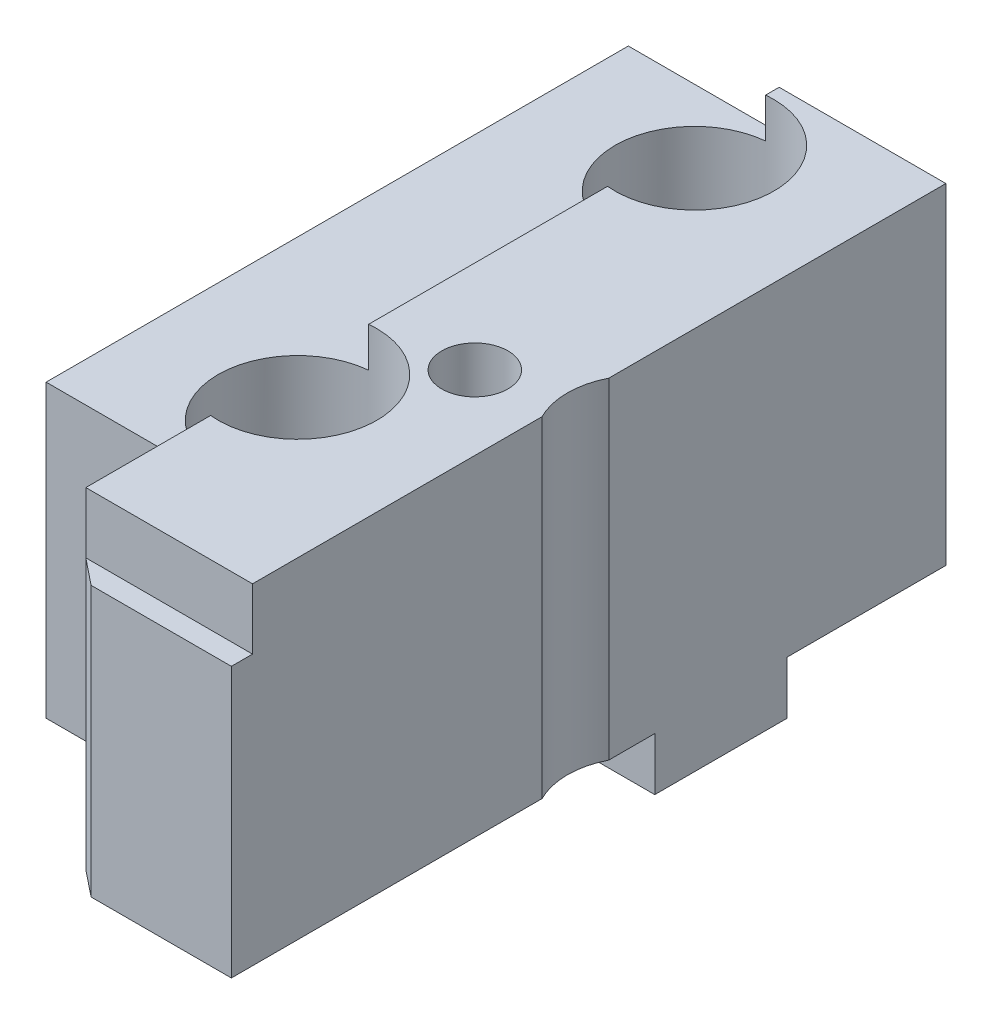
ISO-10303-21;
HEADER;
FILE_DESCRIPTION(('STEP AP214'),'2;1');
FILE_NAME('part.step','',(''),(''),'','','');
FILE_SCHEMA(('AUTOMOTIVE_DESIGN { 1 0 10303 214 1 1 1 1 }'));
ENDSEC;
DATA;
#1=APPLICATION_CONTEXT('core data for automotive mechanical design processes');
#2=APPLICATION_PROTOCOL_DEFINITION('international standard','automotive_design',2000,#1);
#3=PRODUCT_CONTEXT('',#1,'mechanical');
#4=PRODUCT('Part','Part','',(#3));
#5=PRODUCT_RELATED_PRODUCT_CATEGORY('part','',(#4));
#6=PRODUCT_DEFINITION_FORMATION('','',#4);
#7=PRODUCT_DEFINITION_CONTEXT('part definition',#1,'design');
#8=PRODUCT_DEFINITION('design','',#6,#7);
#9=PRODUCT_DEFINITION_SHAPE('','',#8);
#10=(LENGTH_UNIT() NAMED_UNIT(*) SI_UNIT(.MILLI.,.METRE.));
#11=(NAMED_UNIT(*) PLANE_ANGLE_UNIT() SI_UNIT($,.RADIAN.));
#12=(NAMED_UNIT(*) SI_UNIT($,.STERADIAN.) SOLID_ANGLE_UNIT());
#13=UNCERTAINTY_MEASURE_WITH_UNIT(LENGTH_MEASURE(1.E-05),#10,'distance_accuracy_value','');
#14=(GEOMETRIC_REPRESENTATION_CONTEXT(3) GLOBAL_UNCERTAINTY_ASSIGNED_CONTEXT((#13)) GLOBAL_UNIT_ASSIGNED_CONTEXT((#10,
#11,#12)) REPRESENTATION_CONTEXT('',''));
#15=CARTESIAN_POINT('',(0.,0.,0.));
#16=DIRECTION('',(0.,0.,1.));
#17=DIRECTION('',(1.,0.,0.));
#18=AXIS2_PLACEMENT_3D('',#15,#16,#17);
#19=CARTESIAN_POINT('',(0.,0.,-27.));
#20=DIRECTION('',(0.,1.,0.));
#21=DIRECTION('',(0.,0.,-1.));
#22=AXIS2_PLACEMENT_3D('',#19,#20,#21);
#23=PLANE('',#22);
#24=CARTESIAN_POINT('',(-6.,0.,-8.5));
#25=DIRECTION('',(0.,-1.,0.));
#26=DIRECTION('',(0.,0.,-1.));
#27=AXIS2_PLACEMENT_3D('',#24,#25,#26);
#28=CIRCLE('',#27,1.7);
#29=CARTESIAN_POINT('',(-6.,0.,-10.2));
#30=VERTEX_POINT('',#29);
#31=EDGE_CURVE('E201',#30,#30,#28,.T.);
#32=ORIENTED_EDGE('',*,*,#31,.F.);
#33=EDGE_LOOP('',(#32));
#34=FACE_BOUND('',#33,.T.);
#35=CARTESIAN_POINT('',(-2.8,0.,-12.));
#36=DIRECTION('',(0.,-1.,0.));
#37=DIRECTION('',(0.,0.,-1.));
#38=AXIS2_PLACEMENT_3D('',#35,#36,#37);
#39=CIRCLE('',#38,1.25);
#40=CARTESIAN_POINT('',(-2.8,0.,-13.25));
#41=VERTEX_POINT('',#40);
#42=EDGE_CURVE('E232',#41,#41,#39,.T.);
#43=ORIENTED_EDGE('',*,*,#42,.F.);
#44=EDGE_LOOP('',(#43));
#45=FACE_BOUND('',#44,.T.);
#46=DIRECTION('',(1.,0.,0.));
#47=VECTOR('',#46,1.);
#48=CARTESIAN_POINT('',(-12.,0.,-16.));
#49=LINE('',#48,#47);
#50=CARTESIAN_POINT('',(-12.,0.,-16.));
#51=VERTEX_POINT('',#50);
#52=CARTESIAN_POINT('',(0.,0.,-16.));
#53=VERTEX_POINT('',#52);
#54=EDGE_CURVE('E181',#51,#53,#49,.T.);
#55=ORIENTED_EDGE('',*,*,#54,.T.);
#56=DIRECTION('',(0.,0.,1.));
#57=VECTOR('',#56,1.);
#58=CARTESIAN_POINT('',(0.,0.,-27.));
#59=LINE('',#58,#57);
#60=CARTESIAN_POINT('',(0.,0.,-14.2609520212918));
#61=VERTEX_POINT('',#60);
#62=EDGE_CURVE('E298',#53,#61,#59,.T.);
#63=ORIENTED_EDGE('',*,*,#62,.T.);
#64=CARTESIAN_POINT('',(2.5,0.,-13.));
#65=DIRECTION('',(0.,-1.,0.));
#66=DIRECTION('',(0.,0.,-1.));
#67=AXIS2_PLACEMENT_3D('',#64,#65,#66);
#68=CIRCLE('',#67,2.8);
#69=CARTESIAN_POINT('',(0.,0.,-11.7390479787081));
#70=VERTEX_POINT('',#69);
#71=EDGE_CURVE('E236',#70,#61,#68,.T.);
#72=ORIENTED_EDGE('',*,*,#71,.F.);
#73=CARTESIAN_POINT('',(0.,0.,0.));
#74=VERTEX_POINT('',#73);
#75=EDGE_CURVE('E290',#70,#74,#59,.T.);
#76=ORIENTED_EDGE('',*,*,#75,.T.);
#77=DIRECTION('',(1.,0.,0.));
#78=VECTOR('',#77,1.);
#79=CARTESIAN_POINT('',(0.,0.,0.));
#80=LINE('',#79,#78);
#81=CARTESIAN_POINT('',(-5.3,0.,0.));
#82=VERTEX_POINT('',#81);
#83=EDGE_CURVE('E277',#82,#74,#80,.T.);
#84=ORIENTED_EDGE('',*,*,#83,.F.);
#85=DIRECTION('',(-0.780868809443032,0.,-0.624695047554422));
#86=VECTOR('',#85,1.);
#87=CARTESIAN_POINT('',(-6.3,0.,-0.8));
#88=LINE('',#87,#86);
#89=CARTESIAN_POINT('',(-6.3,0.,-0.8));
#90=VERTEX_POINT('',#89);
#91=EDGE_CURVE('E310',#90,#82,#88,.F.);
#92=ORIENTED_EDGE('',*,*,#91,.F.);
#93=DIRECTION('',(0.,0.,1.));
#94=VECTOR('',#93,1.);
#95=CARTESIAN_POINT('',(-6.3,0.,0.));
#96=LINE('',#95,#94);
#97=CARTESIAN_POINT('',(-6.3,0.,-5.));
#98=VERTEX_POINT('',#97);
#99=EDGE_CURVE('E264',#98,#90,#96,.T.);
#100=ORIENTED_EDGE('',*,*,#99,.F.);
#101=DIRECTION('',(1.,0.,0.));
#102=VECTOR('',#101,1.);
#103=CARTESIAN_POINT('',(-12.,0.,-5.));
#104=LINE('',#103,#102);
#105=CARTESIAN_POINT('',(-12.,0.,-5.));
#106=VERTEX_POINT('',#105);
#107=EDGE_CURVE('E261',#106,#98,#104,.T.);
#108=ORIENTED_EDGE('',*,*,#107,.F.);
#109=DIRECTION('',(0.,0.,1.));
#110=VECTOR('',#109,1.);
#111=CARTESIAN_POINT('',(-12.,0.,-27.));
#112=LINE('',#111,#110);
#113=EDGE_CURVE('E307',#51,#106,#112,.T.);
#114=ORIENTED_EDGE('',*,*,#113,.F.);
#115=EDGE_LOOP('',(#55,#63,#72,#76,#84,#92,#100,#108,#114));
#116=FACE_BOUND('',#115,.T.);
#117=ADVANCED_FACE('F16',(#34,#45,#116),#23,.F.);
#118=CARTESIAN_POINT('',(-6.3,12.5,-27.));
#119=DIRECTION('',(1.,0.,0.));
#120=DIRECTION('',(0.,1.,0.));
#121=AXIS2_PLACEMENT_3D('',#118,#119,#120);
#122=PLANE('',#121);
#123=DIRECTION('',(0.,1.,0.));
#124=VECTOR('',#123,1.);
#125=CARTESIAN_POINT('',(-6.3,12.5,-0.8));
#126=LINE('',#125,#124);
#127=CARTESIAN_POINT('',(-6.3,10.2,-0.8));
#128=VERTEX_POINT('',#127);
#129=CARTESIAN_POINT('',(-6.3,12.5,-0.8));
#130=VERTEX_POINT('',#129);
#131=EDGE_CURVE('E245',#128,#130,#126,.T.);
#132=ORIENTED_EDGE('',*,*,#131,.T.);
#133=DIRECTION('',(0.,0.,1.));
#134=VECTOR('',#133,1.);
#135=CARTESIAN_POINT('',(-6.3,12.5,-27.));
#136=LINE('',#135,#134);
#137=CARTESIAN_POINT('',(-6.3,12.5,-5.51503768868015));
#138=VERTEX_POINT('',#137);
#139=EDGE_CURVE('E323',#138,#130,#136,.T.);
#140=ORIENTED_EDGE('',*,*,#139,.F.);
#141=DIRECTION('',(0.,1.,0.));
#142=VECTOR('',#141,1.);
#143=CARTESIAN_POINT('',(-6.3,12.5,-5.51503768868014));
#144=LINE('',#143,#142);
#145=CARTESIAN_POINT('',(-6.3,11.,-5.51503768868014));
#146=VERTEX_POINT('',#145);
#147=EDGE_CURVE('E209',#146,#138,#144,.T.);
#148=ORIENTED_EDGE('',*,*,#147,.F.);
#149=DIRECTION('',(0.,0.,1.));
#150=VECTOR('',#149,1.);
#151=CARTESIAN_POINT('',(-6.3,11.,-27.));
#152=LINE('',#151,#150);
#153=CARTESIAN_POINT('',(-6.3,11.,-5.));
#154=VERTEX_POINT('',#153);
#155=EDGE_CURVE('E327',#146,#154,#152,.T.);
#156=ORIENTED_EDGE('',*,*,#155,.T.);
#157=DIRECTION('',(0.,1.,0.));
#158=VECTOR('',#157,1.);
#159=CARTESIAN_POINT('',(-6.3,0.,-5.));
#160=LINE('',#159,#158);
#161=EDGE_CURVE('E269',#98,#154,#160,.T.);
#162=ORIENTED_EDGE('',*,*,#161,.F.);
#163=ORIENTED_EDGE('',*,*,#99,.T.);
#164=DIRECTION('',(0.,-1.,0.));
#165=VECTOR('',#164,1.);
#166=CARTESIAN_POINT('',(-6.3,12.5,-0.8));
#167=LINE('',#166,#165);
#168=EDGE_CURVE('E193',#128,#90,#167,.T.);
#169=ORIENTED_EDGE('',*,*,#168,.F.);
#170=EDGE_LOOP('',(#132,#140,#148,#156,#162,#163,#169));
#171=FACE_BOUND('',#170,.T.);
#172=ADVANCED_FACE('F385',(#171),#122,.F.);
#173=CARTESIAN_POINT('',(0.,12.5,-27.));
#174=DIRECTION('',(0.,-1.,0.));
#175=DIRECTION('',(0.,0.,1.));
#176=AXIS2_PLACEMENT_3D('',#173,#174,#175);
#177=PLANE('',#176);
#178=CARTESIAN_POINT('',(-2.8,12.5,-12.));
#179=DIRECTION('',(0.,-1.,0.));
#180=DIRECTION('',(0.,0.,-1.));
#181=AXIS2_PLACEMENT_3D('',#178,#179,#180);
#182=CIRCLE('',#181,1.24999999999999);
#183=CARTESIAN_POINT('',(-2.8,12.5,-13.25));
#184=VERTEX_POINT('',#183);
#185=EDGE_CURVE('E229',#184,#184,#182,.T.);
#186=ORIENTED_EDGE('',*,*,#185,.T.);
#187=EDGE_LOOP('',(#186));
#188=FACE_BOUND('',#187,.T.);
#189=CARTESIAN_POINT('',(-6.,12.5,-8.5));
#190=DIRECTION('',(0.,-1.,0.));
#191=DIRECTION('',(0.,0.,-1.));
#192=AXIS2_PLACEMENT_3D('',#189,#190,#191);
#193=CIRCLE('',#192,3.);
#194=CARTESIAN_POINT('',(-6.3,12.5,-11.4849623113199));
#195=VERTEX_POINT('',#194);
#196=EDGE_CURVE('E191',#195,#138,#193,.T.);
#197=ORIENTED_EDGE('',*,*,#196,.T.);
#198=ORIENTED_EDGE('',*,*,#139,.T.);
#199=DIRECTION('',(-1.,0.,0.));
#200=VECTOR('',#199,1.);
#201=CARTESIAN_POINT('',(0.,12.5,-0.8));
#202=LINE('',#201,#200);
#203=CARTESIAN_POINT('',(0.,12.5,-0.8));
#204=VERTEX_POINT('',#203);
#205=EDGE_CURVE('E254',#204,#130,#202,.T.);
#206=ORIENTED_EDGE('',*,*,#205,.F.);
#207=DIRECTION('',(0.,0.,1.));
#208=VECTOR('',#207,1.);
#209=CARTESIAN_POINT('',(0.,12.5,-27.));
#210=LINE('',#209,#208);
#211=CARTESIAN_POINT('',(0.,12.5,-11.7390479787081));
#212=VERTEX_POINT('',#211);
#213=EDGE_CURVE('E318',#212,#204,#210,.T.);
#214=ORIENTED_EDGE('',*,*,#213,.F.);
#215=CARTESIAN_POINT('',(2.5,12.5,-13.));
#216=DIRECTION('',(0.,-1.,0.));
#217=DIRECTION('',(0.,0.,-1.));
#218=AXIS2_PLACEMENT_3D('',#215,#216,#217);
#219=CIRCLE('',#218,2.8);
#220=CARTESIAN_POINT('',(0.,12.5,-14.2609520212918));
#221=VERTEX_POINT('',#220);
#222=EDGE_CURVE('E235',#212,#221,#219,.T.);
#223=ORIENTED_EDGE('',*,*,#222,.T.);
#224=CARTESIAN_POINT('',(0.,12.5,-27.));
#225=VERTEX_POINT('',#224);
#226=EDGE_CURVE('E315',#225,#221,#210,.T.);
#227=ORIENTED_EDGE('',*,*,#226,.F.);
#228=DIRECTION('',(-1.,0.,0.));
#229=VECTOR('',#228,1.);
#230=CARTESIAN_POINT('',(0.,12.5,-27.));
#231=LINE('',#230,#229);
#232=CARTESIAN_POINT('',(-6.3,12.5,-27.));
#233=VERTEX_POINT('',#232);
#234=EDGE_CURVE('E276',#225,#233,#231,.T.);
#235=ORIENTED_EDGE('',*,*,#234,.T.);
#236=CARTESIAN_POINT('',(-6.3,12.5,-26.4849623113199));
#237=VERTEX_POINT('',#236);
#238=EDGE_CURVE('E319',#233,#237,#136,.T.);
#239=ORIENTED_EDGE('',*,*,#238,.T.);
#240=CARTESIAN_POINT('',(-6.,12.5,-23.5));
#241=DIRECTION('',(0.,-1.,0.));
#242=DIRECTION('',(0.,0.,-1.));
#243=AXIS2_PLACEMENT_3D('',#240,#241,#242);
#244=CIRCLE('',#243,3.);
#245=CARTESIAN_POINT('',(-6.3,12.5,-20.5150376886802));
#246=VERTEX_POINT('',#245);
#247=EDGE_CURVE('E212',#237,#246,#244,.T.);
#248=ORIENTED_EDGE('',*,*,#247,.T.);
#249=EDGE_CURVE('E322',#246,#195,#136,.T.);
#250=ORIENTED_EDGE('',*,*,#249,.T.);
#251=EDGE_LOOP('',(#197,#198,#206,#214,#223,#227,#235,#239,#248,#250));
#252=FACE_BOUND('',#251,.T.);
#253=ADVANCED_FACE('F365',(#188,#252),#177,.F.);
#254=ORIENTED_EDGE('',*,*,#249,.F.);
#255=DIRECTION('',(0.,1.,0.));
#256=VECTOR('',#255,1.);
#257=CARTESIAN_POINT('',(-6.3,12.5,-20.5150376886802));
#258=LINE('',#257,#256);
#259=CARTESIAN_POINT('',(-6.3,11.,-20.5150376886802));
#260=VERTEX_POINT('',#259);
#261=EDGE_CURVE('E227',#260,#246,#258,.T.);
#262=ORIENTED_EDGE('',*,*,#261,.F.);
#263=CARTESIAN_POINT('',(-6.3,11.,-11.4849623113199));
#264=VERTEX_POINT('',#263);
#265=EDGE_CURVE('E326',#260,#264,#152,.T.);
#266=ORIENTED_EDGE('',*,*,#265,.T.);
#267=DIRECTION('',(0.,1.,0.));
#268=VECTOR('',#267,1.);
#269=CARTESIAN_POINT('',(-6.3,12.5,-11.4849623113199));
#270=LINE('',#269,#268);
#271=EDGE_CURVE('E206',#195,#264,#270,.F.);
#272=ORIENTED_EDGE('',*,*,#271,.F.);
#273=EDGE_LOOP('',(#254,#262,#266,#272));
#274=FACE_BOUND('',#273,.T.);
#275=ADVANCED_FACE('F397',(#274),#122,.F.);
#276=CARTESIAN_POINT('',(0.,0.,-27.));
#277=DIRECTION('',(-1.,0.,0.));
#278=DIRECTION('',(0.,0.,-1.));
#279=AXIS2_PLACEMENT_3D('',#276,#277,#278);
#280=PLANE('',#279);
#281=CARTESIAN_POINT('',(0.,0.,-27.));
#282=VERTEX_POINT('',#281);
#283=CARTESIAN_POINT('',(0.,0.,-21.));
#284=VERTEX_POINT('',#283);
#285=EDGE_CURVE('E305',#282,#284,#59,.T.);
#286=ORIENTED_EDGE('',*,*,#285,.F.);
#287=DIRECTION('',(0.,1.,0.));
#288=VECTOR('',#287,1.);
#289=CARTESIAN_POINT('',(0.,0.,-27.));
#290=LINE('',#289,#288);
#291=EDGE_CURVE('E274',#282,#225,#290,.T.);
#292=ORIENTED_EDGE('',*,*,#291,.T.);
#293=ORIENTED_EDGE('',*,*,#226,.T.);
#294=DIRECTION('',(0.,1.,0.));
#295=VECTOR('',#294,1.);
#296=CARTESIAN_POINT('',(0.,0.,-14.2609520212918));
#297=LINE('',#296,#295);
#298=EDGE_CURVE('E243',#61,#221,#297,.T.);
#299=ORIENTED_EDGE('',*,*,#298,.F.);
#300=ORIENTED_EDGE('',*,*,#62,.F.);
#301=DIRECTION('',(0.,1.,0.));
#302=VECTOR('',#301,1.);
#303=CARTESIAN_POINT('',(0.,0.,-16.));
#304=LINE('',#303,#302);
#305=CARTESIAN_POINT('',(0.,-2.,-16.));
#306=VERTEX_POINT('',#305);
#307=EDGE_CURVE('E172',#306,#53,#304,.T.);
#308=ORIENTED_EDGE('',*,*,#307,.F.);
#309=DIRECTION('',(0.,0.,1.));
#310=VECTOR('',#309,1.);
#311=CARTESIAN_POINT('',(0.,-2.,-21.));
#312=LINE('',#311,#310);
#313=CARTESIAN_POINT('',(0.,-2.,-21.));
#314=VERTEX_POINT('',#313);
#315=EDGE_CURVE('E174',#314,#306,#312,.T.);
#316=ORIENTED_EDGE('',*,*,#315,.F.);
#317=DIRECTION('',(0.,-1.,0.));
#318=VECTOR('',#317,1.);
#319=CARTESIAN_POINT('',(0.,0.,-21.));
#320=LINE('',#319,#318);
#321=EDGE_CURVE('E154',#284,#314,#320,.T.);
#322=ORIENTED_EDGE('',*,*,#321,.F.);
#323=EDGE_LOOP('',(#286,#292,#293,#299,#300,#308,#316,#322));
#324=FACE_BOUND('',#323,.T.);
#325=ADVANCED_FACE('F340',(#324),#280,.F.);
#326=ORIENTED_EDGE('',*,*,#213,.T.);
#327=DIRECTION('',(0.,1.,0.));
#328=VECTOR('',#327,1.);
#329=CARTESIAN_POINT('',(0.,12.5,-0.8));
#330=LINE('',#329,#328);
#331=CARTESIAN_POINT('',(0.,10.2,-0.8));
#332=VERTEX_POINT('',#331);
#333=EDGE_CURVE('E249',#332,#204,#330,.T.);
#334=ORIENTED_EDGE('',*,*,#333,.F.);
#335=DIRECTION('',(0.,0.,-1.));
#336=VECTOR('',#335,1.);
#337=CARTESIAN_POINT('',(0.,10.2,0.));
#338=LINE('',#337,#336);
#339=CARTESIAN_POINT('',(0.,10.2,0.));
#340=VERTEX_POINT('',#339);
#341=EDGE_CURVE('E246',#340,#332,#338,.T.);
#342=ORIENTED_EDGE('',*,*,#341,.F.);
#343=DIRECTION('',(0.,1.,0.));
#344=VECTOR('',#343,1.);
#345=CARTESIAN_POINT('',(0.,0.,0.));
#346=LINE('',#345,#344);
#347=EDGE_CURVE('E272',#74,#340,#346,.T.);
#348=ORIENTED_EDGE('',*,*,#347,.F.);
#349=ORIENTED_EDGE('',*,*,#75,.F.);
#350=DIRECTION('',(0.,1.,0.));
#351=VECTOR('',#350,1.);
#352=CARTESIAN_POINT('',(0.,0.,-11.7390479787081));
#353=LINE('',#352,#351);
#354=EDGE_CURVE('E239',#212,#70,#353,.F.);
#355=ORIENTED_EDGE('',*,*,#354,.F.);
#356=EDGE_LOOP('',(#326,#334,#342,#348,#349,#355));
#357=FACE_BOUND('',#356,.T.);
#358=ADVANCED_FACE('F376',(#357),#280,.F.);
#359=ORIENTED_EDGE('',*,*,#238,.F.);
#360=DIRECTION('',(0.,-1.,0.));
#361=VECTOR('',#360,1.);
#362=CARTESIAN_POINT('',(-6.3,12.5,-27.));
#363=LINE('',#362,#361);
#364=CARTESIAN_POINT('',(-6.3,11.,-27.));
#365=VERTEX_POINT('',#364);
#366=EDGE_CURVE('E280',#233,#365,#363,.T.);
#367=ORIENTED_EDGE('',*,*,#366,.T.);
#368=CARTESIAN_POINT('',(-6.3,11.,-26.4849623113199));
#369=VERTEX_POINT('',#368);
#370=EDGE_CURVE('E324',#365,#369,#152,.T.);
#371=ORIENTED_EDGE('',*,*,#370,.T.);
#372=DIRECTION('',(0.,1.,0.));
#373=VECTOR('',#372,1.);
#374=CARTESIAN_POINT('',(-6.3,12.5,-26.4849623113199));
#375=LINE('',#374,#373);
#376=EDGE_CURVE('E224',#237,#369,#375,.F.);
#377=ORIENTED_EDGE('',*,*,#376,.F.);
#378=EDGE_LOOP('',(#359,#367,#371,#377));
#379=FACE_BOUND('',#378,.T.);
#380=ADVANCED_FACE('F402',(#379),#122,.F.);
#381=CARTESIAN_POINT('',(-12.,11.,-27.));
#382=DIRECTION('',(0.,-1.,0.));
#383=DIRECTION('',(0.,0.,1.));
#384=AXIS2_PLACEMENT_3D('',#381,#382,#383);
#385=PLANE('',#384);
#386=ORIENTED_EDGE('',*,*,#265,.F.);
#387=CARTESIAN_POINT('',(-6.,11.,-23.5));
#388=DIRECTION('',(0.,1.,0.));
#389=DIRECTION('',(0.,0.,1.));
#390=AXIS2_PLACEMENT_3D('',#387,#388,#389);
#391=CIRCLE('',#390,3.);
#392=EDGE_CURVE('E194',#369,#260,#391,.T.);
#393=ORIENTED_EDGE('',*,*,#392,.F.);
#394=ORIENTED_EDGE('',*,*,#370,.F.);
#395=DIRECTION('',(-1.,0.,0.));
#396=VECTOR('',#395,1.);
#397=CARTESIAN_POINT('',(-12.,11.,-27.));
#398=LINE('',#397,#396);
#399=CARTESIAN_POINT('',(-12.,11.,-27.));
#400=VERTEX_POINT('',#399);
#401=EDGE_CURVE('E283',#365,#400,#398,.T.);
#402=ORIENTED_EDGE('',*,*,#401,.T.);
#403=DIRECTION('',(0.,0.,1.));
#404=VECTOR('',#403,1.);
#405=CARTESIAN_POINT('',(-12.,11.,-27.));
#406=LINE('',#405,#404);
#407=CARTESIAN_POINT('',(-12.,11.,-5.));
#408=VERTEX_POINT('',#407);
#409=EDGE_CURVE('E328',#400,#408,#406,.T.);
#410=ORIENTED_EDGE('',*,*,#409,.T.);
#411=DIRECTION('',(1.,0.,0.));
#412=VECTOR('',#411,1.);
#413=CARTESIAN_POINT('',(-12.,11.,-5.));
#414=LINE('',#413,#412);
#415=EDGE_CURVE('E256',#408,#154,#414,.T.);
#416=ORIENTED_EDGE('',*,*,#415,.T.);
#417=ORIENTED_EDGE('',*,*,#155,.F.);
#418=CARTESIAN_POINT('',(-6.,11.,-8.5));
#419=DIRECTION('',(0.,1.,0.));
#420=DIRECTION('',(0.,0.,1.));
#421=AXIS2_PLACEMENT_3D('',#418,#419,#420);
#422=CIRCLE('',#421,3.);
#423=EDGE_CURVE('E204',#264,#146,#422,.T.);
#424=ORIENTED_EDGE('',*,*,#423,.F.);
#425=EDGE_LOOP('',(#386,#393,#394,#402,#410,#416,#417,#424));
#426=FACE_BOUND('',#425,.T.);
#427=ADVANCED_FACE('F355',(#426),#385,.F.);
#428=CARTESIAN_POINT('',(-12.,0.,-27.));
#429=DIRECTION('',(1.,0.,0.));
#430=DIRECTION('',(0.,0.,1.));
#431=AXIS2_PLACEMENT_3D('',#428,#429,#430);
#432=PLANE('',#431);
#433=ORIENTED_EDGE('',*,*,#409,.F.);
#434=DIRECTION('',(0.,-1.,0.));
#435=VECTOR('',#434,1.);
#436=CARTESIAN_POINT('',(-12.,0.,-27.));
#437=LINE('',#436,#435);
#438=CARTESIAN_POINT('',(-12.,0.,-27.));
#439=VERTEX_POINT('',#438);
#440=EDGE_CURVE('E286',#400,#439,#437,.T.);
#441=ORIENTED_EDGE('',*,*,#440,.T.);
#442=CARTESIAN_POINT('',(-12.,0.,-21.));
#443=VERTEX_POINT('',#442);
#444=EDGE_CURVE('E171',#439,#443,#112,.T.);
#445=ORIENTED_EDGE('',*,*,#444,.T.);
#446=DIRECTION('',(0.,-1.,0.));
#447=VECTOR('',#446,1.);
#448=CARTESIAN_POINT('',(-12.,0.,-21.));
#449=LINE('',#448,#447);
#450=CARTESIAN_POINT('',(-12.,-2.,-21.));
#451=VERTEX_POINT('',#450);
#452=EDGE_CURVE('E152',#443,#451,#449,.T.);
#453=ORIENTED_EDGE('',*,*,#452,.T.);
#454=DIRECTION('',(0.,0.,1.));
#455=VECTOR('',#454,1.);
#456=CARTESIAN_POINT('',(-12.,-2.,-21.));
#457=LINE('',#456,#455);
#458=CARTESIAN_POINT('',(-12.,-2.,-16.));
#459=VERTEX_POINT('',#458);
#460=EDGE_CURVE('E162',#451,#459,#457,.T.);
#461=ORIENTED_EDGE('',*,*,#460,.T.);
#462=DIRECTION('',(0.,1.,0.));
#463=VECTOR('',#462,1.);
#464=CARTESIAN_POINT('',(-12.,0.,-16.));
#465=LINE('',#464,#463);
#466=EDGE_CURVE('E159',#459,#51,#465,.T.);
#467=ORIENTED_EDGE('',*,*,#466,.T.);
#468=ORIENTED_EDGE('',*,*,#113,.T.);
#469=DIRECTION('',(0.,1.,0.));
#470=VECTOR('',#469,1.);
#471=CARTESIAN_POINT('',(-12.,0.,-5.));
#472=LINE('',#471,#470);
#473=EDGE_CURVE('E267',#106,#408,#472,.T.);
#474=ORIENTED_EDGE('',*,*,#473,.T.);
#475=EDGE_LOOP('',(#433,#441,#445,#453,#461,#467,#468,#474));
#476=FACE_BOUND('',#475,.T.);
#477=ADVANCED_FACE('F168',(#476),#432,.F.);
#478=CARTESIAN_POINT('',(-6.,0.,-23.5));
#479=DIRECTION('',(0.,-1.,0.));
#480=DIRECTION('',(0.,0.,-1.));
#481=AXIS2_PLACEMENT_3D('',#478,#479,#480);
#482=CIRCLE('',#481,1.7);
#483=CARTESIAN_POINT('',(-6.,0.,-25.2));
#484=VERTEX_POINT('',#483);
#485=EDGE_CURVE('E221',#484,#484,#482,.T.);
#486=ORIENTED_EDGE('',*,*,#485,.F.);
#487=EDGE_LOOP('',(#486));
#488=FACE_BOUND('',#487,.T.);
#489=ORIENTED_EDGE('',*,*,#444,.F.);
#490=DIRECTION('',(1.,0.,0.));
#491=VECTOR('',#490,1.);
#492=CARTESIAN_POINT('',(0.,0.,-27.));
#493=LINE('',#492,#491);
#494=EDGE_CURVE('E288',#439,#282,#493,.T.);
#495=ORIENTED_EDGE('',*,*,#494,.T.);
#496=ORIENTED_EDGE('',*,*,#285,.T.);
#497=DIRECTION('',(1.,0.,0.));
#498=VECTOR('',#497,1.);
#499=CARTESIAN_POINT('',(-12.,0.,-21.));
#500=LINE('',#499,#498);
#501=EDGE_CURVE('E33',#443,#284,#500,.T.);
#502=ORIENTED_EDGE('',*,*,#501,.F.);
#503=EDGE_LOOP('',(#489,#495,#496,#502));
#504=FACE_BOUND('',#503,.T.);
#505=ADVANCED_FACE('F362',(#488,#504),#23,.F.);
#506=CARTESIAN_POINT('',(0.,0.,-27.));
#507=DIRECTION('',(0.,0.,-1.));
#508=DIRECTION('',(1.,0.,0.));
#509=AXIS2_PLACEMENT_3D('',#506,#507,#508);
#510=PLANE('',#509);
#511=ORIENTED_EDGE('',*,*,#291,.F.);
#512=ORIENTED_EDGE('',*,*,#494,.F.);
#513=ORIENTED_EDGE('',*,*,#440,.F.);
#514=ORIENTED_EDGE('',*,*,#401,.F.);
#515=ORIENTED_EDGE('',*,*,#366,.F.);
#516=ORIENTED_EDGE('',*,*,#234,.F.);
#517=EDGE_LOOP('',(#511,#512,#513,#514,#515,#516));
#518=FACE_BOUND('',#517,.T.);
#519=ADVANCED_FACE('F358',(#518),#510,.T.);
#520=CARTESIAN_POINT('',(0.,0.,0.));
#521=DIRECTION('',(0.,0.,-1.));
#522=DIRECTION('',(1.,0.,0.));
#523=AXIS2_PLACEMENT_3D('',#520,#521,#522);
#524=PLANE('',#523);
#525=ORIENTED_EDGE('',*,*,#83,.T.);
#526=ORIENTED_EDGE('',*,*,#347,.T.);
#527=DIRECTION('',(-1.,0.,0.));
#528=VECTOR('',#527,1.);
#529=CARTESIAN_POINT('',(0.,10.2,0.));
#530=LINE('',#529,#528);
#531=CARTESIAN_POINT('',(-5.3,10.2,0.));
#532=VERTEX_POINT('',#531);
#533=EDGE_CURVE('E251',#340,#532,#530,.T.);
#534=ORIENTED_EDGE('',*,*,#533,.T.);
#535=DIRECTION('',(0.,1.,0.));
#536=VECTOR('',#535,1.);
#537=CARTESIAN_POINT('',(-5.3,0.,0.));
#538=LINE('',#537,#536);
#539=EDGE_CURVE('E25',#82,#532,#538,.T.);
#540=ORIENTED_EDGE('',*,*,#539,.F.);
#541=EDGE_LOOP('',(#525,#526,#534,#540));
#542=FACE_BOUND('',#541,.T.);
#543=ADVANCED_FACE('F380',(#542),#524,.F.);
#544=CARTESIAN_POINT('',(-12.,0.,-5.));
#545=DIRECTION('',(0.,0.,-1.));
#546=DIRECTION('',(1.,0.,0.));
#547=AXIS2_PLACEMENT_3D('',#544,#545,#546);
#548=PLANE('',#547);
#549=ORIENTED_EDGE('',*,*,#415,.F.);
#550=ORIENTED_EDGE('',*,*,#473,.F.);
#551=ORIENTED_EDGE('',*,*,#107,.T.);
#552=ORIENTED_EDGE('',*,*,#161,.T.);
#553=EDGE_LOOP('',(#549,#550,#551,#552));
#554=FACE_BOUND('',#553,.T.);
#555=ADVANCED_FACE('F352',(#554),#548,.F.);
#556=CARTESIAN_POINT('',(0.,12.5,-0.8));
#557=DIRECTION('',(0.,0.,-1.));
#558=DIRECTION('',(0.,-1.,0.));
#559=AXIS2_PLACEMENT_3D('',#556,#557,#558);
#560=PLANE('',#559);
#561=ORIENTED_EDGE('',*,*,#131,.F.);
#562=DIRECTION('',(-1.,0.,0.));
#563=VECTOR('',#562,1.);
#564=CARTESIAN_POINT('',(0.,10.2,-0.8));
#565=LINE('',#564,#563);
#566=EDGE_CURVE('E257',#332,#128,#565,.T.);
#567=ORIENTED_EDGE('',*,*,#566,.F.);
#568=ORIENTED_EDGE('',*,*,#333,.T.);
#569=ORIENTED_EDGE('',*,*,#205,.T.);
#570=EDGE_LOOP('',(#561,#567,#568,#569));
#571=FACE_BOUND('',#570,.T.);
#572=ADVANCED_FACE('F405',(#571),#560,.F.);
#573=CARTESIAN_POINT('',(0.,10.2,0.));
#574=DIRECTION('',(0.,-1.,0.));
#575=DIRECTION('',(1.,0.,0.));
#576=AXIS2_PLACEMENT_3D('',#573,#574,#575);
#577=PLANE('',#576);
#578=ORIENTED_EDGE('',*,*,#533,.F.);
#579=ORIENTED_EDGE('',*,*,#341,.T.);
#580=ORIENTED_EDGE('',*,*,#566,.T.);
#581=DIRECTION('',(0.780868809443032,0.,0.624695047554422));
#582=VECTOR('',#581,1.);
#583=CARTESIAN_POINT('',(-6.3,10.2,-0.8));
#584=LINE('',#583,#582);
#585=EDGE_CURVE('E11',#532,#128,#584,.F.);
#586=ORIENTED_EDGE('',*,*,#585,.F.);
#587=EDGE_LOOP('',(#578,#579,#580,#586));
#588=FACE_BOUND('',#587,.T.);
#589=ADVANCED_FACE('F406',(#588),#577,.F.);
#590=CARTESIAN_POINT('',(2.5,0.,-13.));
#591=DIRECTION('',(0.,1.,0.));
#592=DIRECTION('',(0.,0.,-1.));
#593=AXIS2_PLACEMENT_3D('',#590,#591,#592);
#594=CYLINDRICAL_SURFACE('',#593,2.8);
#595=ORIENTED_EDGE('',*,*,#71,.T.);
#596=ORIENTED_EDGE('',*,*,#298,.T.);
#597=ORIENTED_EDGE('',*,*,#222,.F.);
#598=ORIENTED_EDGE('',*,*,#354,.T.);
#599=EDGE_LOOP('',(#595,#596,#597,#598));
#600=FACE_BOUND('',#599,.T.);
#601=ADVANCED_FACE('F371',(#600),#594,.F.);
#602=CARTESIAN_POINT('',(-2.8,12.5,-12.));
#603=DIRECTION('',(0.,1.,0.));
#604=DIRECTION('',(0.,0.,-1.));
#605=AXIS2_PLACEMENT_3D('',#602,#603,#604);
#606=CYLINDRICAL_SURFACE('',#605,1.25);
#607=ORIENTED_EDGE('',*,*,#42,.T.);
#608=EDGE_LOOP('',(#607));
#609=FACE_BOUND('',#608,.T.);
#610=ORIENTED_EDGE('',*,*,#185,.F.);
#611=EDGE_LOOP('',(#610));
#612=FACE_BOUND('',#611,.T.);
#613=ADVANCED_FACE('F415',(#609,#612),#606,.F.);
#614=CARTESIAN_POINT('',(-6.,12.5,-23.5));
#615=DIRECTION('',(0.,1.,0.));
#616=DIRECTION('',(0.,0.,-1.));
#617=AXIS2_PLACEMENT_3D('',#614,#615,#616);
#618=CYLINDRICAL_SURFACE('',#617,3.);
#619=CARTESIAN_POINT('',(-6.,7.1,-23.5));
#620=DIRECTION('',(0.,-1.,0.));
#621=DIRECTION('',(0.,0.,-1.));
#622=AXIS2_PLACEMENT_3D('',#619,#620,#621);
#623=CIRCLE('',#622,3.);
#624=CARTESIAN_POINT('',(-6.,7.1,-26.5));
#625=VERTEX_POINT('',#624);
#626=EDGE_CURVE('E215',#625,#625,#623,.T.);
#627=ORIENTED_EDGE('',*,*,#626,.T.);
#628=EDGE_LOOP('',(#627));
#629=FACE_BOUND('',#628,.T.);
#630=ORIENTED_EDGE('',*,*,#392,.T.);
#631=ORIENTED_EDGE('',*,*,#261,.T.);
#632=ORIENTED_EDGE('',*,*,#247,.F.);
#633=ORIENTED_EDGE('',*,*,#376,.T.);
#634=EDGE_LOOP('',(#630,#631,#632,#633));
#635=FACE_BOUND('',#634,.T.);
#636=ADVANCED_FACE('F400',(#629,#635),#618,.F.);
#637=CARTESIAN_POINT('',(-6.,12.5,-23.5));
#638=DIRECTION('',(0.,1.,0.));
#639=DIRECTION('',(0.,0.,-1.));
#640=AXIS2_PLACEMENT_3D('',#637,#638,#639);
#641=CYLINDRICAL_SURFACE('',#640,1.7);
#642=ORIENTED_EDGE('',*,*,#485,.T.);
#643=EDGE_LOOP('',(#642));
#644=FACE_BOUND('',#643,.T.);
#645=CARTESIAN_POINT('',(-6.,7.1,-23.5));
#646=DIRECTION('',(0.,-1.,0.));
#647=DIRECTION('',(0.,0.,-1.));
#648=AXIS2_PLACEMENT_3D('',#645,#646,#647);
#649=CIRCLE('',#648,1.7);
#650=CARTESIAN_POINT('',(-6.,7.1,-25.2));
#651=VERTEX_POINT('',#650);
#652=EDGE_CURVE('E218',#651,#651,#649,.T.);
#653=ORIENTED_EDGE('',*,*,#652,.F.);
#654=EDGE_LOOP('',(#653));
#655=FACE_BOUND('',#654,.T.);
#656=ADVANCED_FACE('F441',(#644,#655),#641,.F.);
#657=CARTESIAN_POINT('',(-4.3,7.1,-23.5));
#658=DIRECTION('',(0.,-1.,0.));
#659=DIRECTION('',(0.,0.,1.));
#660=AXIS2_PLACEMENT_3D('',#657,#658,#659);
#661=PLANE('',#660);
#662=ORIENTED_EDGE('',*,*,#652,.T.);
#663=EDGE_LOOP('',(#662));
#664=FACE_BOUND('',#663,.T.);
#665=ORIENTED_EDGE('',*,*,#626,.F.);
#666=EDGE_LOOP('',(#665));
#667=FACE_BOUND('',#666,.T.);
#668=ADVANCED_FACE('F444',(#664,#667),#661,.F.);
#669=CARTESIAN_POINT('',(-6.,12.5,-8.5));
#670=DIRECTION('',(0.,1.,0.));
#671=DIRECTION('',(0.,0.,-1.));
#672=AXIS2_PLACEMENT_3D('',#669,#670,#671);
#673=CYLINDRICAL_SURFACE('',#672,3.);
#674=CARTESIAN_POINT('',(-6.,7.1,-8.5));
#675=DIRECTION('',(0.,-1.,0.));
#676=DIRECTION('',(0.,0.,-1.));
#677=AXIS2_PLACEMENT_3D('',#674,#675,#676);
#678=CIRCLE('',#677,3.);
#679=CARTESIAN_POINT('',(-6.,7.1,-11.5));
#680=VERTEX_POINT('',#679);
#681=EDGE_CURVE('E195',#680,#680,#678,.T.);
#682=ORIENTED_EDGE('',*,*,#681,.T.);
#683=EDGE_LOOP('',(#682));
#684=FACE_BOUND('',#683,.T.);
#685=ORIENTED_EDGE('',*,*,#423,.T.);
#686=ORIENTED_EDGE('',*,*,#147,.T.);
#687=ORIENTED_EDGE('',*,*,#196,.F.);
#688=ORIENTED_EDGE('',*,*,#271,.T.);
#689=EDGE_LOOP('',(#685,#686,#687,#688));
#690=FACE_BOUND('',#689,.T.);
#691=ADVANCED_FACE('F393',(#684,#690),#673,.F.);
#692=CARTESIAN_POINT('',(-6.,12.5,-8.5));
#693=DIRECTION('',(0.,1.,0.));
#694=DIRECTION('',(0.,0.,-1.));
#695=AXIS2_PLACEMENT_3D('',#692,#693,#694);
#696=CYLINDRICAL_SURFACE('',#695,1.7);
#697=ORIENTED_EDGE('',*,*,#31,.T.);
#698=EDGE_LOOP('',(#697));
#699=FACE_BOUND('',#698,.T.);
#700=CARTESIAN_POINT('',(-6.,7.1,-8.5));
#701=DIRECTION('',(0.,-1.,0.));
#702=DIRECTION('',(0.,0.,-1.));
#703=AXIS2_PLACEMENT_3D('',#700,#701,#702);
#704=CIRCLE('',#703,1.7);
#705=CARTESIAN_POINT('',(-6.,7.1,-10.2));
#706=VERTEX_POINT('',#705);
#707=EDGE_CURVE('E198',#706,#706,#704,.T.);
#708=ORIENTED_EDGE('',*,*,#707,.F.);
#709=EDGE_LOOP('',(#708));
#710=FACE_BOUND('',#709,.T.);
#711=ADVANCED_FACE('F462',(#699,#710),#696,.F.);
#712=CARTESIAN_POINT('',(-4.3,7.1,-8.5));
#713=DIRECTION('',(0.,-1.,0.));
#714=DIRECTION('',(0.,0.,1.));
#715=AXIS2_PLACEMENT_3D('',#712,#713,#714);
#716=PLANE('',#715);
#717=ORIENTED_EDGE('',*,*,#707,.T.);
#718=EDGE_LOOP('',(#717));
#719=FACE_BOUND('',#718,.T.);
#720=ORIENTED_EDGE('',*,*,#681,.F.);
#721=EDGE_LOOP('',(#720));
#722=FACE_BOUND('',#721,.T.);
#723=ADVANCED_FACE('F465',(#719,#722),#716,.F.);
#724=CARTESIAN_POINT('',(-6.3,12.5,-0.8));
#725=DIRECTION('',(0.624695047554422,0.,-0.780868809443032));
#726=DIRECTION('',(0.,-1.,0.));
#727=AXIS2_PLACEMENT_3D('',#724,#725,#726);
#728=PLANE('',#727);
#729=ORIENTED_EDGE('',*,*,#585,.T.);
#730=ORIENTED_EDGE('',*,*,#168,.T.);
#731=ORIENTED_EDGE('',*,*,#91,.T.);
#732=ORIENTED_EDGE('',*,*,#539,.T.);
#733=EDGE_LOOP('',(#729,#730,#731,#732));
#734=FACE_BOUND('',#733,.T.);
#735=ADVANCED_FACE('F18',(#734),#728,.F.);
#736=CARTESIAN_POINT('',(-12.,0.,-21.));
#737=DIRECTION('',(0.,0.,-1.));
#738=DIRECTION('',(1.,0.,0.));
#739=AXIS2_PLACEMENT_3D('',#736,#737,#738);
#740=PLANE('',#739);
#741=ORIENTED_EDGE('',*,*,#321,.T.);
#742=DIRECTION('',(1.,0.,0.));
#743=VECTOR('',#742,1.);
#744=CARTESIAN_POINT('',(-12.,-2.,-21.));
#745=LINE('',#744,#743);
#746=EDGE_CURVE('E148',#451,#314,#745,.T.);
#747=ORIENTED_EDGE('',*,*,#746,.F.);
#748=ORIENTED_EDGE('',*,*,#452,.F.);
#749=ORIENTED_EDGE('',*,*,#501,.T.);
#750=EDGE_LOOP('',(#741,#747,#748,#749));
#751=FACE_BOUND('',#750,.T.);
#752=ADVANCED_FACE('F150',(#751),#740,.T.);
#753=CARTESIAN_POINT('',(-12.,0.,-16.));
#754=DIRECTION('',(0.,0.,1.));
#755=DIRECTION('',(-1.,0.,0.));
#756=AXIS2_PLACEMENT_3D('',#753,#754,#755);
#757=PLANE('',#756);
#758=ORIENTED_EDGE('',*,*,#307,.T.);
#759=ORIENTED_EDGE('',*,*,#54,.F.);
#760=ORIENTED_EDGE('',*,*,#466,.F.);
#761=DIRECTION('',(1.,0.,0.));
#762=VECTOR('',#761,1.);
#763=CARTESIAN_POINT('',(-12.,-2.,-16.));
#764=LINE('',#763,#762);
#765=EDGE_CURVE('E158',#459,#306,#764,.T.);
#766=ORIENTED_EDGE('',*,*,#765,.T.);
#767=EDGE_LOOP('',(#758,#759,#760,#766));
#768=FACE_BOUND('',#767,.T.);
#769=ADVANCED_FACE('F344',(#768),#757,.T.);
#770=CARTESIAN_POINT('',(-12.,-2.,-21.));
#771=DIRECTION('',(0.,-1.,0.));
#772=DIRECTION('',(0.,0.,1.));
#773=AXIS2_PLACEMENT_3D('',#770,#771,#772);
#774=PLANE('',#773);
#775=ORIENTED_EDGE('',*,*,#315,.T.);
#776=ORIENTED_EDGE('',*,*,#765,.F.);
#777=ORIENTED_EDGE('',*,*,#460,.F.);
#778=ORIENTED_EDGE('',*,*,#746,.T.);
#779=EDGE_LOOP('',(#775,#776,#777,#778));
#780=FACE_BOUND('',#779,.T.);
#781=ADVANCED_FACE('F163',(#780),#774,.T.);
#782=CLOSED_SHELL('',(#117,#172,#253,#275,#325,#358,#380,#427,#477,#505,#519,#543,#555,#572,
#589,#601,#613,#636,#656,#668,#691,#711,#723,#735,#752,#769,#781));
#783=MANIFOLD_SOLID_BREP('B1',#782);
#784=ADVANCED_BREP_SHAPE_REPRESENTATION('',(#18,#783),#14);
#785=SHAPE_DEFINITION_REPRESENTATION(#9,#784);
ENDSEC;
END-ISO-10303-21;
